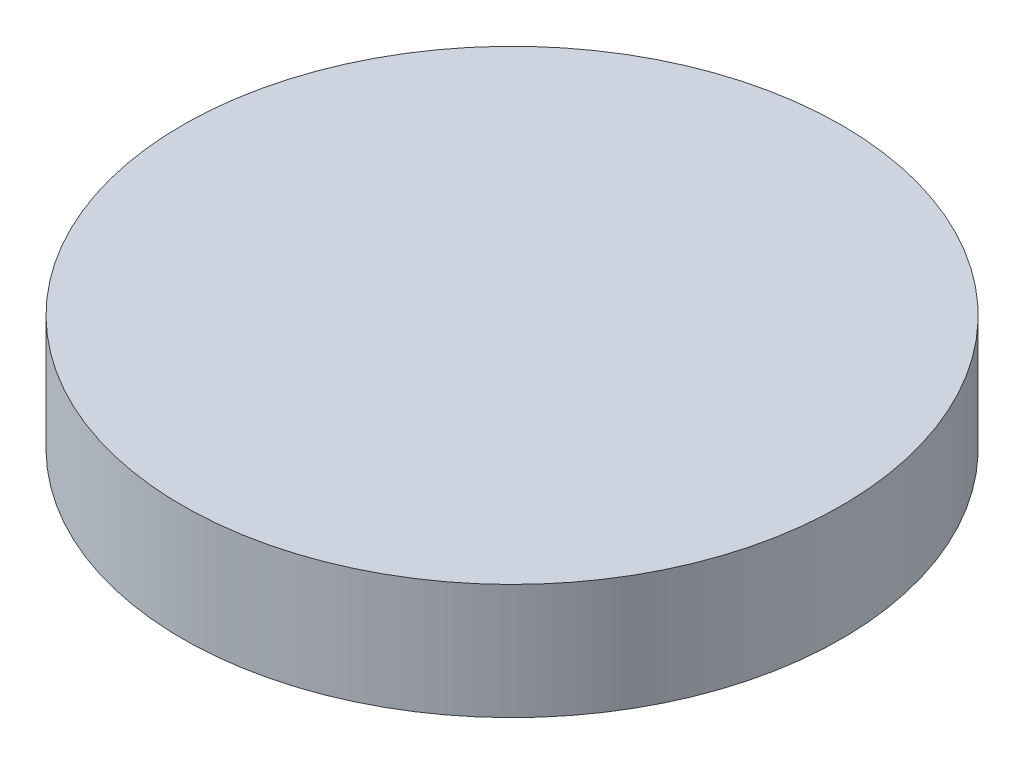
from build123d import *


with BuildPart() as part:
    # Sketch 1 → Revolve 1 (revolve)
    with BuildSketch(Plane.XY, mode=Mode.PRIVATE) as revolve_1_sk:
        Polygon((0, 400), (-800, 400), (-800, 120), (-600, 0), (0, 0), align=None)
    revolve(revolve_1_sk.sketch.rotate(Axis((0, 0, 0), (0, 1, 0)), 270), axis=Axis((0, 0, 0), (0, 1, 0)))


solid = part.part
